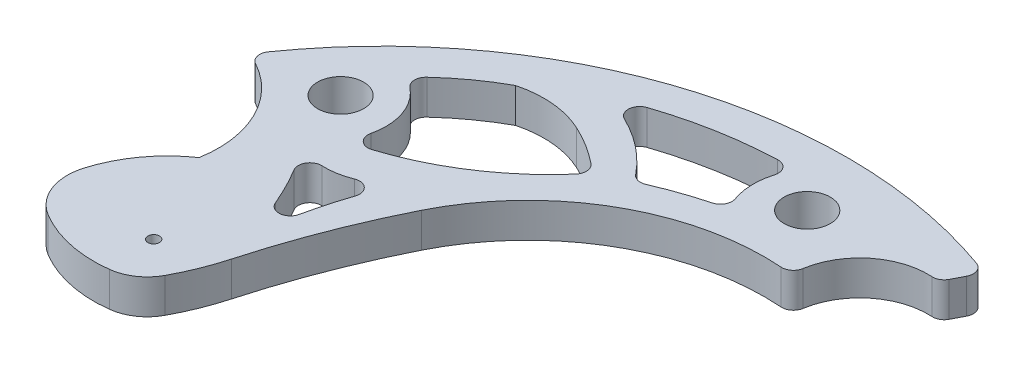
ISO-10303-21;
HEADER;
FILE_DESCRIPTION(('STEP AP214'),'2;1');
FILE_NAME('part.step','',(''),(''),'','','');
FILE_SCHEMA(('AUTOMOTIVE_DESIGN { 1 0 10303 214 1 1 1 1 }'));
ENDSEC;
DATA;
#1=APPLICATION_CONTEXT('core data for automotive mechanical design processes');
#2=APPLICATION_PROTOCOL_DEFINITION('international standard','automotive_design',2000,#1);
#3=PRODUCT_CONTEXT('',#1,'mechanical');
#4=PRODUCT('Part','Part','',(#3));
#5=PRODUCT_RELATED_PRODUCT_CATEGORY('part','',(#4));
#6=PRODUCT_DEFINITION_FORMATION('','',#4);
#7=PRODUCT_DEFINITION_CONTEXT('part definition',#1,'design');
#8=PRODUCT_DEFINITION('design','',#6,#7);
#9=PRODUCT_DEFINITION_SHAPE('','',#8);
#10=(LENGTH_UNIT() NAMED_UNIT(*) SI_UNIT(.MILLI.,.METRE.));
#11=(NAMED_UNIT(*) PLANE_ANGLE_UNIT() SI_UNIT($,.RADIAN.));
#12=(NAMED_UNIT(*) SI_UNIT($,.STERADIAN.) SOLID_ANGLE_UNIT());
#13=UNCERTAINTY_MEASURE_WITH_UNIT(LENGTH_MEASURE(1.E-05),#10,'distance_accuracy_value','');
#14=(GEOMETRIC_REPRESENTATION_CONTEXT(3) GLOBAL_UNCERTAINTY_ASSIGNED_CONTEXT((#13)) GLOBAL_UNIT_ASSIGNED_CONTEXT((#10,
#11,#12)) REPRESENTATION_CONTEXT('',''));
#15=CARTESIAN_POINT('',(0.,0.,0.));
#16=DIRECTION('',(0.,0.,1.));
#17=DIRECTION('',(1.,0.,0.));
#18=AXIS2_PLACEMENT_3D('',#15,#16,#17);
#19=CARTESIAN_POINT('',(36.1901769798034,3.,-25.0084204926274));
#20=DIRECTION('',(0.,-1.,0.));
#21=DIRECTION('',(0.,0.,-1.));
#22=AXIS2_PLACEMENT_3D('',#19,#20,#21);
#23=PLANE('',#22);
#24=CARTESIAN_POINT('',(26.1522054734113,3.,-30.4959441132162));
#25=DIRECTION('',(0.,1.,0.));
#26=DIRECTION('',(0.,0.,1.));
#27=AXIS2_PLACEMENT_3D('',#24,#25,#26);
#28=CIRCLE('',#27,2.);
#29=CARTESIAN_POINT('',(26.1522054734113,3.,-28.4959441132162));
#30=VERTEX_POINT('',#29);
#31=EDGE_CURVE('E691',#30,#30,#28,.T.);
#32=ORIENTED_EDGE('',*,*,#31,.F.);
#33=EDGE_LOOP('',(#32));
#34=FACE_BOUND('',#33,.T.);
#35=CARTESIAN_POINT('',(-2.6982624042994,3.,-18.9009881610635));
#36=DIRECTION('',(0.,1.,0.));
#37=DIRECTION('',(0.,0.,1.));
#38=AXIS2_PLACEMENT_3D('',#35,#36,#37);
#39=CIRCLE('',#38,2.);
#40=CARTESIAN_POINT('',(-2.6982624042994,3.,-16.9009881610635));
#41=VERTEX_POINT('',#40);
#42=EDGE_CURVE('E697',#41,#41,#39,.T.);
#43=ORIENTED_EDGE('',*,*,#42,.F.);
#44=EDGE_LOOP('',(#43));
#45=FACE_BOUND('',#44,.T.);
#46=CARTESIAN_POINT('',(22.3332809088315,3.,1.18231446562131));
#47=DIRECTION('',(0.,1.,0.));
#48=DIRECTION('',(0.,0.,-1.));
#49=AXIS2_PLACEMENT_3D('',#46,#47,#48);
#50=CIRCLE('',#49,34.221936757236);
#51=CARTESIAN_POINT('',(21.077096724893,3.,-33.0165591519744));
#52=VERTEX_POINT('',#51);
#53=CARTESIAN_POINT('',(11.4905747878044,3.,-31.27653146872));
#54=VERTEX_POINT('',#53);
#55=EDGE_CURVE('E703',#52,#54,#50,.T.);
#56=ORIENTED_EDGE('',*,*,#55,.F.);
#57=CARTESIAN_POINT('',(21.1138037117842,3.,-32.0172330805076));
#58=DIRECTION('',(0.,-1.,0.));
#59=DIRECTION('',(0.,0.,-1.));
#60=AXIS2_PLACEMENT_3D('',#57,#58,#59);
#61=CIRCLE('',#60,1.);
#62=CARTESIAN_POINT('',(22.0723027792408,3.,-31.732137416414));
#63=VERTEX_POINT('',#62);
#64=EDGE_CURVE('E476',#52,#63,#61,.T.);
#65=ORIENTED_EDGE('',*,*,#64,.T.);
#66=CARTESIAN_POINT('',(27.4530725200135,3.,-30.1316829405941));
#67=DIRECTION('',(0.,-1.,0.));
#68=DIRECTION('',(0.,0.,1.));
#69=AXIS2_PLACEMENT_3D('',#66,#67,#68);
#70=CIRCLE('',#69,5.61374541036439);
#71=CARTESIAN_POINT('',(22.1672578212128,3.,-28.2411008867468));
#72=VERTEX_POINT('',#71);
#73=EDGE_CURVE('E308',#72,#63,#70,.T.);
#74=ORIENTED_EDGE('',*,*,#73,.F.);
#75=CARTESIAN_POINT('',(21.2256734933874,3.,-27.9043235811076));
#76=DIRECTION('',(0.,-1.,0.));
#77=DIRECTION('',(0.,0.,-1.));
#78=AXIS2_PLACEMENT_3D('',#75,#76,#77);
#79=CIRCLE('',#78,1.);
#80=CARTESIAN_POINT('',(21.4834971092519,3.,-26.9381315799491));
#81=VERTEX_POINT('',#80);
#82=EDGE_CURVE('E468',#72,#81,#79,.T.);
#83=ORIENTED_EDGE('',*,*,#82,.T.);
#84=CARTESIAN_POINT('',(29.4187713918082,3.,2.79924725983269));
#85=DIRECTION('',(0.,-1.,0.));
#86=DIRECTION('',(0.,0.,1.));
#87=AXIS2_PLACEMENT_3D('',#84,#85,#86);
#88=CIRCLE('',#87,30.7779186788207);
#89=CARTESIAN_POINT('',(17.2098235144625,3.,-25.453573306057));
#90=VERTEX_POINT('',#89);
#91=EDGE_CURVE('E710',#90,#81,#88,.T.);
#92=ORIENTED_EDGE('',*,*,#91,.F.);
#93=CARTESIAN_POINT('',(16.8131447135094,3.,-26.3715307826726));
#94=DIRECTION('',(0.,-1.,0.));
#95=DIRECTION('',(0.,0.,-1.));
#96=AXIS2_PLACEMENT_3D('',#93,#94,#95);
#97=CIRCLE('',#96,1.);
#98=CARTESIAN_POINT('',(16.0350198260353,3.,-25.7434211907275));
#99=VERTEX_POINT('',#98);
#100=EDGE_CURVE('E472',#90,#99,#97,.T.);
#101=ORIENTED_EDGE('',*,*,#100,.T.);
#102=CARTESIAN_POINT('',(5.57927762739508,3.,-17.303449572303));
#103=DIRECTION('',(0.,-1.,0.));
#104=DIRECTION('',(0.,0.,-1.));
#105=AXIS2_PLACEMENT_3D('',#102,#103,#104);
#106=CIRCLE('',#105,13.4371003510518);
#107=CARTESIAN_POINT('',(11.3760120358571,3.,-29.4258889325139));
#108=VERTEX_POINT('',#107);
#109=EDGE_CURVE('E706',#108,#99,#106,.T.);
#110=ORIENTED_EDGE('',*,*,#109,.F.);
#111=CARTESIAN_POINT('',(11.8074097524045,3.,-30.3280507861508));
#112=DIRECTION('',(0.,-1.,0.));
#113=DIRECTION('',(0.,0.,-1.));
#114=AXIS2_PLACEMENT_3D('',#111,#112,#113);
#115=CIRCLE('',#114,1.);
#116=EDGE_CURVE('E480',#108,#54,#115,.T.);
#117=ORIENTED_EDGE('',*,*,#116,.T.);
#118=EDGE_LOOP('',(#56,#65,#74,#83,#92,#101,#110,#117));
#119=FACE_BOUND('',#118,.T.);
#120=CARTESIAN_POINT('',(0.,3.,0.));
#121=DIRECTION('',(0.,1.,0.));
#122=DIRECTION('',(0.,0.,1.));
#123=AXIS2_PLACEMENT_3D('',#120,#121,#122);
#124=CIRCLE('',#123,0.5);
#125=CARTESIAN_POINT('',(0.,3.,0.5));
#126=VERTEX_POINT('',#125);
#127=EDGE_CURVE('E319',#126,#126,#124,.T.);
#128=ORIENTED_EDGE('',*,*,#127,.F.);
#129=EDGE_LOOP('',(#128));
#130=FACE_BOUND('',#129,.T.);
#131=CARTESIAN_POINT('',(23.9208432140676,3.,4.15098831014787));
#132=DIRECTION('',(0.,1.,0.));
#133=DIRECTION('',(0.,0.,-1.));
#134=AXIS2_PLACEMENT_3D('',#131,#132,#133);
#135=CIRCLE('',#134,40.3519483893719);
#136=CARTESIAN_POINT('',(37.44992086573,3.,-33.865373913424));
#137=VERTEX_POINT('',#136);
#138=CARTESIAN_POINT('',(-9.09792331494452,3.,-19.0447180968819));
#139=VERTEX_POINT('',#138);
#140=EDGE_CURVE('E331',#137,#139,#135,.T.);
#141=ORIENTED_EDGE('',*,*,#140,.T.);
#142=CARTESIAN_POINT('',(-8.27965386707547,3.,-18.4698832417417));
#143=DIRECTION('',(0.,-1.,0.));
#144=DIRECTION('',(0.,0.,-1.));
#145=AXIS2_PLACEMENT_3D('',#142,#143,#144);
#146=CIRCLE('',#145,1.);
#147=CARTESIAN_POINT('',(-8.75589303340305,3.,-17.5905674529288));
#148=VERTEX_POINT('',#147);
#149=EDGE_CURVE('E504',#139,#148,#146,.F.);
#150=ORIENTED_EDGE('',*,*,#149,.T.);
#151=CARTESIAN_POINT('',(-13.0537265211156,3.,-9.65515787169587));
#152=DIRECTION('',(0.,-1.,0.));
#153=DIRECTION('',(0.,0.,1.));
#154=AXIS2_PLACEMENT_3D('',#151,#152,#153);
#155=CIRCLE('',#154,9.02452757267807);
#156=CARTESIAN_POINT('',(-4.16393548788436,3.,-8.10154489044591));
#157=VERTEX_POINT('',#156);
#158=EDGE_CURVE('E334',#148,#157,#155,.T.);
#159=ORIENTED_EDGE('',*,*,#158,.T.);
#160=CARTESIAN_POINT('',(1.93480597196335,3.,0.752602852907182));
#161=DIRECTION('',(0.,1.,0.));
#162=DIRECTION('',(0.,0.,1.));
#163=AXIS2_PLACEMENT_3D('',#160,#161,#162);
#164=CIRCLE('',#163,10.751305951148);
#165=CARTESIAN_POINT('',(-8.36767887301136,3.,-2.32138245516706));
#166=VERTEX_POINT('',#165);
#167=EDGE_CURVE('E336',#157,#166,#164,.T.);
#168=ORIENTED_EDGE('',*,*,#167,.T.);
#169=CARTESIAN_POINT('',(-4.12389303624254,3.,-1.05515052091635));
#170=DIRECTION('',(0.,1.,0.));
#171=DIRECTION('',(0.,0.,1.));
#172=AXIS2_PLACEMENT_3D('',#169,#170,#171);
#173=CIRCLE('',#172,4.42866362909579);
#174=CARTESIAN_POINT('',(-6.40207694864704,3.,2.74260402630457));
#175=VERTEX_POINT('',#174);
#176=EDGE_CURVE('E338',#166,#175,#173,.T.);
#177=ORIENTED_EDGE('',*,*,#176,.T.);
#178=CARTESIAN_POINT('',(-0.950217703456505,3.,-6.34569789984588));
#179=DIRECTION('',(0.,1.,0.));
#180=DIRECTION('',(0.,0.,1.));
#181=AXIS2_PLACEMENT_3D('',#178,#179,#180);
#182=CIRCLE('',#181,10.5981130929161);
#183=CARTESIAN_POINT('',(0.36441854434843,3.,4.17056249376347));
#184=VERTEX_POINT('',#183);
#185=EDGE_CURVE('E340',#175,#184,#182,.T.);
#186=ORIENTED_EDGE('',*,*,#185,.T.);
#187=CARTESIAN_POINT('',(-0.100414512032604,3.,0.452191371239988));
#188=DIRECTION('',(0.,1.,0.));
#189=DIRECTION('',(0.,0.,1.));
#190=AXIS2_PLACEMENT_3D('',#187,#188,#189);
#191=CIRCLE('',#190,3.74731284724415);
#192=CARTESIAN_POINT('',(3.1999000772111,3.,2.22709339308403));
#193=VERTEX_POINT('',#192);
#194=EDGE_CURVE('E342',#184,#193,#191,.T.);
#195=ORIENTED_EDGE('',*,*,#194,.T.);
#196=CARTESIAN_POINT('',(-14.4275555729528,3.,-7.25291399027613));
#197=DIRECTION('',(0.,1.,0.));
#198=DIRECTION('',(0.,0.,-1.));
#199=AXIS2_PLACEMENT_3D('',#196,#197,#198);
#200=CIRCLE('',#199,20.0149377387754);
#201=CARTESIAN_POINT('',(4.8563646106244,3.,-1.89304878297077));
#202=VERTEX_POINT('',#201);
#203=EDGE_CURVE('E344',#193,#202,#200,.T.);
#204=ORIENTED_EDGE('',*,*,#203,.T.);
#205=CARTESIAN_POINT('',(68.9783873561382,3.,15.929333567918));
#206=DIRECTION('',(0.,-1.,0.));
#207=DIRECTION('',(0.,0.,-1.));
#208=AXIS2_PLACEMENT_3D('',#205,#206,#207);
#209=CIRCLE('',#208,66.5527693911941);
#210=CARTESIAN_POINT('',(9.42965914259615,3.,-13.7896852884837));
#211=VERTEX_POINT('',#210);
#212=EDGE_CURVE('E346',#202,#211,#209,.T.);
#213=ORIENTED_EDGE('',*,*,#212,.T.);
#214=CARTESIAN_POINT('',(27.8052220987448,3.,-4.61898226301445));
#215=DIRECTION('',(0.,-1.,0.));
#216=DIRECTION('',(0.,0.,1.));
#217=AXIS2_PLACEMENT_3D('',#214,#215,#216);
#218=CIRCLE('',#217,20.5368719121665);
#219=CARTESIAN_POINT('',(29.2760593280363,3.,-25.1031162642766));
#220=VERTEX_POINT('',#219);
#221=EDGE_CURVE('E348',#211,#220,#218,.T.);
#222=ORIENTED_EDGE('',*,*,#221,.T.);
#223=CARTESIAN_POINT('',(29.3476786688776,3.,-26.1005483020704));
#224=DIRECTION('',(0.,-1.,0.));
#225=DIRECTION('',(0.,0.,-1.));
#226=AXIS2_PLACEMENT_3D('',#223,#224,#225);
#227=CIRCLE('',#226,1.);
#228=CARTESIAN_POINT('',(30.3351793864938,3.,-25.942933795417));
#229=VERTEX_POINT('',#228);
#230=EDGE_CURVE('E498',#220,#229,#227,.F.);
#231=ORIENTED_EDGE('',*,*,#230,.T.);
#232=CARTESIAN_POINT('',(36.1901769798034,3.,-25.0084204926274));
#233=DIRECTION('',(0.,-1.,0.));
#234=DIRECTION('',(0.,0.,-1.));
#235=AXIS2_PLACEMENT_3D('',#232,#233,#234);
#236=CIRCLE('',#235,5.92910717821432);
#237=CARTESIAN_POINT('',(36.5403153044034,3.,-30.9271800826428));
#238=VERTEX_POINT('',#237);
#239=EDGE_CURVE('E325',#229,#238,#236,.T.);
#240=ORIENTED_EDGE('',*,*,#239,.T.);
#241=CARTESIAN_POINT('',(36.5993694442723,3.,-31.9254348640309));
#242=DIRECTION('',(0.,-1.,0.));
#243=DIRECTION('',(0.,0.,-1.));
#244=AXIS2_PLACEMENT_3D('',#241,#242,#243);
#245=CIRCLE('',#244,1.);
#246=CARTESIAN_POINT('',(37.4878917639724,3.,-31.4666014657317));
#247=VERTEX_POINT('',#246);
#248=EDGE_CURVE('E500',#238,#247,#245,.F.);
#249=ORIENTED_EDGE('',*,*,#248,.T.);
#250=DIRECTION('',(0.458833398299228,0.,-0.888522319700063));
#251=VECTOR('',#250,1.);
#252=CARTESIAN_POINT('',(37.1723743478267,3.,-30.8556078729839));
#253=LINE('',#252,#251);
#254=CARTESIAN_POINT('',(38.0031662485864,3.,-32.4644208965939));
#255=VERTEX_POINT('',#254);
#256=EDGE_CURVE('E328',#247,#255,#253,.T.);
#257=ORIENTED_EDGE('',*,*,#256,.T.);
#258=CARTESIAN_POINT('',(37.1146439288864,3.,-32.9232542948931));
#259=DIRECTION('',(0.,-1.,0.));
#260=DIRECTION('',(0.,0.,-1.));
#261=AXIS2_PLACEMENT_3D('',#258,#259,#260);
#262=CIRCLE('',#261,1.);
#263=EDGE_CURVE('E502',#255,#137,#262,.F.);
#264=ORIENTED_EDGE('',*,*,#263,.T.);
#265=EDGE_LOOP('',(#141,#150,#159,#168,#177,#186,#195,#204,#213,#222,#231,#240,#249,#257,#264));
#266=FACE_BOUND('',#265,.T.);
#267=CARTESIAN_POINT('',(-3.46325413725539,3.,-18.5524292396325));
#268=DIRECTION('',(0.,-1.,0.));
#269=DIRECTION('',(0.,0.,1.));
#270=AXIS2_PLACEMENT_3D('',#267,#268,#269);
#271=CIRCLE('',#270,5.06437808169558);
#272=CARTESIAN_POINT('',(-0.279386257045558,3.,-22.4908185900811));
#273=VERTEX_POINT('',#272);
#274=CARTESIAN_POINT('',(1.46239452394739,3.,-17.3751821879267));
#275=VERTEX_POINT('',#274);
#276=EDGE_CURVE('E317',#273,#275,#271,.T.);
#277=ORIENTED_EDGE('',*,*,#276,.F.);
#278=CARTESIAN_POINT('',(0.349292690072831,3.,-23.2684835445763));
#279=DIRECTION('',(0.,-1.,0.));
#280=DIRECTION('',(0.,0.,-1.));
#281=AXIS2_PLACEMENT_3D('',#278,#279,#280);
#282=CIRCLE('',#281,1.);
#283=CARTESIAN_POINT('',(-0.33020244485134,3.,-24.0021635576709));
#284=VERTEX_POINT('',#283);
#285=EDGE_CURVE('E444',#273,#284,#282,.T.);
#286=ORIENTED_EDGE('',*,*,#285,.T.);
#287=CARTESIAN_POINT('',(15.0701998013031,3.,-7.37368935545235));
#288=DIRECTION('',(0.,1.,0.));
#289=DIRECTION('',(0.,0.,-1.));
#290=AXIS2_PLACEMENT_3D('',#287,#288,#289);
#291=CIRCLE('',#290,22.6644775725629);
#292=CARTESIAN_POINT('',(4.1342229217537,3.,-27.2252120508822));
#293=VERTEX_POINT('',#292);
#294=EDGE_CURVE('E299',#293,#284,#291,.T.);
#295=ORIENTED_EDGE('',*,*,#294,.F.);
#296=CARTESIAN_POINT('',(6.32074341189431,3.,-18.9009881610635));
#297=DIRECTION('',(0.,1.,0.));
#298=DIRECTION('',(0.,0.,-1.));
#299=AXIS2_PLACEMENT_3D('',#296,#297,#298);
#300=CIRCLE('',#299,8.60660067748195);
#301=CARTESIAN_POINT('',(9.95984203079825,3.,-26.7003815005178));
#302=VERTEX_POINT('',#301);
#303=EDGE_CURVE('E284',#302,#293,#300,.T.);
#304=ORIENTED_EDGE('',*,*,#303,.F.);
#305=CARTESIAN_POINT('',(3.1407436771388,3.,-12.0855452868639));
#306=DIRECTION('',(0.,1.,0.));
#307=DIRECTION('',(0.,0.,-1.));
#308=AXIS2_PLACEMENT_3D('',#305,#306,#307);
#309=CIRCLE('',#308,16.1274157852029);
#310=CARTESIAN_POINT('',(13.2816867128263,3.,-24.6256734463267));
#311=VERTEX_POINT('',#310);
#312=EDGE_CURVE('E273',#311,#302,#309,.T.);
#313=ORIENTED_EDGE('',*,*,#312,.F.);
#314=CARTESIAN_POINT('',(12.6528852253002,3.,-23.8481075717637));
#315=DIRECTION('',(0.,-1.,0.));
#316=DIRECTION('',(0.,0.,-1.));
#317=AXIS2_PLACEMENT_3D('',#314,#315,#316);
#318=CIRCLE('',#317,1.);
#319=CARTESIAN_POINT('',(13.4045600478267,3.,-23.1885736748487));
#320=VERTEX_POINT('',#319);
#321=EDGE_CURVE('E436',#311,#320,#318,.T.);
#322=ORIENTED_EDGE('',*,*,#321,.T.);
#323=CARTESIAN_POINT('',(-4.57734917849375,3.,-38.9662454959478));
#324=DIRECTION('',(0.,1.,0.));
#325=DIRECTION('',(0.,0.,-1.));
#326=AXIS2_PLACEMENT_3D('',#323,#324,#325);
#327=CIRCLE('',#326,23.922457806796);
#328=CARTESIAN_POINT('',(2.74091751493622,3.,-16.1906673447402));
#329=VERTEX_POINT('',#328);
#330=EDGE_CURVE('E285',#329,#320,#327,.T.);
#331=ORIENTED_EDGE('',*,*,#330,.F.);
#332=CARTESIAN_POINT('',(2.4350013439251,3.,-17.1427257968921));
#333=DIRECTION('',(0.,-1.,0.));
#334=DIRECTION('',(0.,0.,-1.));
#335=AXIS2_PLACEMENT_3D('',#332,#333,#334);
#336=CIRCLE('',#335,1.);
#337=EDGE_CURVE('E440',#329,#275,#336,.T.);
#338=ORIENTED_EDGE('',*,*,#337,.T.);
#339=EDGE_LOOP('',(#277,#286,#295,#304,#313,#322,#331,#338));
#340=FACE_BOUND('',#339,.T.);
#341=CARTESIAN_POINT('',(-21.7653135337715,3.,2.25661155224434));
#342=DIRECTION('',(0.,-1.,0.));
#343=DIRECTION('',(0.,0.,-1.));
#344=AXIS2_PLACEMENT_3D('',#341,#342,#343);
#345=CIRCLE('',#344,26.3858876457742);
#346=CARTESIAN_POINT('',(0.874070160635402,3.,-11.2960034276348));
#347=VERTEX_POINT('',#346);
#348=CARTESIAN_POINT('',(2.54587875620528,3.,-7.99916712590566));
#349=VERTEX_POINT('',#348);
#350=EDGE_CURVE('E666',#347,#349,#345,.T.);
#351=ORIENTED_EDGE('',*,*,#350,.F.);
#352=CARTESIAN_POINT('',(1.73208123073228,3.,-11.8096346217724));
#353=DIRECTION('',(0.,-1.,0.));
#354=DIRECTION('',(0.,0.,-1.));
#355=AXIS2_PLACEMENT_3D('',#352,#353,#354);
#356=CIRCLE('',#355,1.);
#357=CARTESIAN_POINT('',(1.7734922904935,3.,-12.8087768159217));
#358=VERTEX_POINT('',#357);
#359=EDGE_CURVE('E418',#347,#358,#356,.T.);
#360=ORIENTED_EDGE('',*,*,#359,.T.);
#361=CARTESIAN_POINT('',(2.0097532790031,3.,-18.5091458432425));
#362=DIRECTION('',(0.,-1.,0.));
#363=DIRECTION('',(0.,0.,1.));
#364=AXIS2_PLACEMENT_3D('',#361,#362,#363);
#365=CIRCLE('',#364,5.7052630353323);
#366=CARTESIAN_POINT('',(4.16538173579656,3.,-13.2267891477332));
#367=VERTEX_POINT('',#366);
#368=EDGE_CURVE('E677',#367,#358,#365,.T.);
#369=ORIENTED_EDGE('',*,*,#368,.F.);
#370=CARTESIAN_POINT('',(4.5432132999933,3.,-12.3009147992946));
#371=DIRECTION('',(0.,-1.,0.));
#372=DIRECTION('',(0.,0.,-1.));
#373=AXIS2_PLACEMENT_3D('',#370,#371,#372);
#374=CIRCLE('',#373,1.);
#375=CARTESIAN_POINT('',(5.49075599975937,3.,-11.9812855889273));
#376=VERTEX_POINT('',#375);
#377=EDGE_CURVE('E414',#367,#376,#374,.T.);
#378=ORIENTED_EDGE('',*,*,#377,.T.);
#379=CARTESIAN_POINT('',(38.2916214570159,3.,-0.916755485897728));
#380=DIRECTION('',(0.,-1.,0.));
#381=DIRECTION('',(0.,0.,-1.));
#382=AXIS2_PLACEMENT_3D('',#379,#380,#381);
#383=CIRCLE('',#382,34.6167676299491);
#384=CARTESIAN_POINT('',(4.44500194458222,3.,-8.17808792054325));
#385=VERTEX_POINT('',#384);
#386=EDGE_CURVE('E675',#385,#376,#383,.T.);
#387=ORIENTED_EDGE('',*,*,#386,.F.);
#388=CARTESIAN_POINT('',(3.4672497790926,3.,-8.38785136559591));
#389=DIRECTION('',(0.,-1.,0.));
#390=DIRECTION('',(0.,0.,-1.));
#391=AXIS2_PLACEMENT_3D('',#388,#389,#390);
#392=CIRCLE('',#391,1.);
#393=EDGE_CURVE('E410',#385,#349,#392,.T.);
#394=ORIENTED_EDGE('',*,*,#393,.T.);
#395=EDGE_LOOP('',(#351,#360,#369,#378,#387,#394));
#396=FACE_BOUND('',#395,.T.);
#397=ADVANCED_FACE('F32',(#34,#45,#119,#130,#266,#340,#396),#23,.F.);
#398=CARTESIAN_POINT('',(36.1901769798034,0.,-25.0084204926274));
#399=DIRECTION('',(0.,-1.,0.));
#400=DIRECTION('',(0.,0.,-1.));
#401=AXIS2_PLACEMENT_3D('',#398,#399,#400);
#402=PLANE('',#401);
#403=CARTESIAN_POINT('',(-2.6982624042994,0.,-18.9009881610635));
#404=DIRECTION('',(0.,1.,0.));
#405=DIRECTION('',(0.,0.,1.));
#406=AXIS2_PLACEMENT_3D('',#403,#404,#405);
#407=CIRCLE('',#406,2.);
#408=CARTESIAN_POINT('',(-2.6982624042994,0.,-16.9009881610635));
#409=VERTEX_POINT('',#408);
#410=EDGE_CURVE('E694',#409,#409,#407,.T.);
#411=ORIENTED_EDGE('',*,*,#410,.T.);
#412=EDGE_LOOP('',(#411));
#413=FACE_BOUND('',#412,.T.);
#414=CARTESIAN_POINT('',(-13.0537265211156,0.,-9.65515787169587));
#415=DIRECTION('',(0.,-1.,0.));
#416=DIRECTION('',(0.,0.,1.));
#417=AXIS2_PLACEMENT_3D('',#414,#415,#416);
#418=CIRCLE('',#417,9.02452757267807);
#419=CARTESIAN_POINT('',(-8.75589303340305,0.,-17.5905674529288));
#420=VERTEX_POINT('',#419);
#421=CARTESIAN_POINT('',(-4.16393548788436,0.,-8.10154489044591));
#422=VERTEX_POINT('',#421);
#423=EDGE_CURVE('E358',#420,#422,#418,.T.);
#424=ORIENTED_EDGE('',*,*,#423,.F.);
#425=CARTESIAN_POINT('',(-8.27965386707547,0.,-18.4698832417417));
#426=DIRECTION('',(0.,-1.,0.));
#427=DIRECTION('',(0.,0.,-1.));
#428=AXIS2_PLACEMENT_3D('',#425,#426,#427);
#429=CIRCLE('',#428,1.);
#430=CARTESIAN_POINT('',(-9.09792331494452,0.,-19.0447180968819));
#431=VERTEX_POINT('',#430);
#432=EDGE_CURVE('E491',#420,#431,#429,.T.);
#433=ORIENTED_EDGE('',*,*,#432,.T.);
#434=CARTESIAN_POINT('',(23.9208432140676,0.,4.15098831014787));
#435=DIRECTION('',(0.,1.,0.));
#436=DIRECTION('',(0.,0.,-1.));
#437=AXIS2_PLACEMENT_3D('',#434,#435,#436);
#438=CIRCLE('',#437,40.3519483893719);
#439=CARTESIAN_POINT('',(37.44992086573,0.,-33.865373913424));
#440=VERTEX_POINT('',#439);
#441=EDGE_CURVE('E355',#440,#431,#438,.T.);
#442=ORIENTED_EDGE('',*,*,#441,.F.);
#443=CARTESIAN_POINT('',(37.1146439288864,0.,-32.9232542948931));
#444=DIRECTION('',(0.,-1.,0.));
#445=DIRECTION('',(0.,0.,-1.));
#446=AXIS2_PLACEMENT_3D('',#443,#444,#445);
#447=CIRCLE('',#446,1.);
#448=CARTESIAN_POINT('',(38.0031662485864,0.,-32.4644208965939));
#449=VERTEX_POINT('',#448);
#450=EDGE_CURVE('E489',#440,#449,#447,.T.);
#451=ORIENTED_EDGE('',*,*,#450,.T.);
#452=DIRECTION('',(0.458833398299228,0.,-0.888522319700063));
#453=VECTOR('',#452,1.);
#454=CARTESIAN_POINT('',(37.1723743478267,0.,-30.8556078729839));
#455=LINE('',#454,#453);
#456=CARTESIAN_POINT('',(37.4878917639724,0.,-31.4666014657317));
#457=VERTEX_POINT('',#456);
#458=EDGE_CURVE('E353',#457,#449,#455,.T.);
#459=ORIENTED_EDGE('',*,*,#458,.F.);
#460=CARTESIAN_POINT('',(36.5993694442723,0.,-31.9254348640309));
#461=DIRECTION('',(0.,-1.,0.));
#462=DIRECTION('',(0.,0.,-1.));
#463=AXIS2_PLACEMENT_3D('',#460,#461,#462);
#464=CIRCLE('',#463,1.);
#465=CARTESIAN_POINT('',(36.5403153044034,0.,-30.9271800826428));
#466=VERTEX_POINT('',#465);
#467=EDGE_CURVE('E487',#457,#466,#464,.T.);
#468=ORIENTED_EDGE('',*,*,#467,.T.);
#469=CARTESIAN_POINT('',(36.1901769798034,0.,-25.0084204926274));
#470=DIRECTION('',(0.,-1.,0.));
#471=DIRECTION('',(0.,0.,-1.));
#472=AXIS2_PLACEMENT_3D('',#469,#470,#471);
#473=CIRCLE('',#472,5.92910717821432);
#474=CARTESIAN_POINT('',(30.3351793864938,0.,-25.942933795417));
#475=VERTEX_POINT('',#474);
#476=EDGE_CURVE('E322',#475,#466,#473,.T.);
#477=ORIENTED_EDGE('',*,*,#476,.F.);
#478=CARTESIAN_POINT('',(29.3476786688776,0.,-26.1005483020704));
#479=DIRECTION('',(0.,-1.,0.));
#480=DIRECTION('',(0.,0.,-1.));
#481=AXIS2_PLACEMENT_3D('',#478,#479,#480);
#482=CIRCLE('',#481,1.);
#483=CARTESIAN_POINT('',(29.2760593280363,0.,-25.1031162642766));
#484=VERTEX_POINT('',#483);
#485=EDGE_CURVE('E485',#475,#484,#482,.T.);
#486=ORIENTED_EDGE('',*,*,#485,.T.);
#487=CARTESIAN_POINT('',(27.8052220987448,0.,-4.61898226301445));
#488=DIRECTION('',(0.,-1.,0.));
#489=DIRECTION('',(0.,0.,1.));
#490=AXIS2_PLACEMENT_3D('',#487,#488,#489);
#491=CIRCLE('',#490,20.5368719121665);
#492=CARTESIAN_POINT('',(9.42965914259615,0.,-13.7896852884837));
#493=VERTEX_POINT('',#492);
#494=EDGE_CURVE('E329',#493,#484,#491,.T.);
#495=ORIENTED_EDGE('',*,*,#494,.F.);
#496=CARTESIAN_POINT('',(68.9783873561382,0.,15.929333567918));
#497=DIRECTION('',(0.,-1.,0.));
#498=DIRECTION('',(0.,0.,-1.));
#499=AXIS2_PLACEMENT_3D('',#496,#497,#498);
#500=CIRCLE('',#499,66.5527693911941);
#501=CARTESIAN_POINT('',(4.8563646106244,0.,-1.89304878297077));
#502=VERTEX_POINT('',#501);
#503=EDGE_CURVE('E370',#502,#493,#500,.T.);
#504=ORIENTED_EDGE('',*,*,#503,.F.);
#505=CARTESIAN_POINT('',(-14.4275555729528,0.,-7.25291399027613));
#506=DIRECTION('',(0.,1.,0.));
#507=DIRECTION('',(0.,0.,-1.));
#508=AXIS2_PLACEMENT_3D('',#505,#506,#507);
#509=CIRCLE('',#508,20.0149377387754);
#510=CARTESIAN_POINT('',(3.1999000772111,0.,2.22709339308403));
#511=VERTEX_POINT('',#510);
#512=EDGE_CURVE('E368',#511,#502,#509,.T.);
#513=ORIENTED_EDGE('',*,*,#512,.F.);
#514=CARTESIAN_POINT('',(-0.100414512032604,0.,0.452191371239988));
#515=DIRECTION('',(0.,1.,0.));
#516=DIRECTION('',(0.,0.,1.));
#517=AXIS2_PLACEMENT_3D('',#514,#515,#516);
#518=CIRCLE('',#517,3.74731284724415);
#519=CARTESIAN_POINT('',(0.36441854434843,0.,4.17056249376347));
#520=VERTEX_POINT('',#519);
#521=EDGE_CURVE('E366',#520,#511,#518,.T.);
#522=ORIENTED_EDGE('',*,*,#521,.F.);
#523=CARTESIAN_POINT('',(-0.950217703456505,0.,-6.34569789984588));
#524=DIRECTION('',(0.,1.,0.));
#525=DIRECTION('',(0.,0.,1.));
#526=AXIS2_PLACEMENT_3D('',#523,#524,#525);
#527=CIRCLE('',#526,10.5981130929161);
#528=CARTESIAN_POINT('',(-6.40207694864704,0.,2.74260402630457));
#529=VERTEX_POINT('',#528);
#530=EDGE_CURVE('E364',#529,#520,#527,.T.);
#531=ORIENTED_EDGE('',*,*,#530,.F.);
#532=CARTESIAN_POINT('',(-4.12389303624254,0.,-1.05515052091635));
#533=DIRECTION('',(0.,1.,0.));
#534=DIRECTION('',(0.,0.,1.));
#535=AXIS2_PLACEMENT_3D('',#532,#533,#534);
#536=CIRCLE('',#535,4.42866362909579);
#537=CARTESIAN_POINT('',(-8.36767887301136,0.,-2.32138245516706));
#538=VERTEX_POINT('',#537);
#539=EDGE_CURVE('E362',#538,#529,#536,.T.);
#540=ORIENTED_EDGE('',*,*,#539,.F.);
#541=CARTESIAN_POINT('',(1.93480597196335,0.,0.752602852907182));
#542=DIRECTION('',(0.,1.,0.));
#543=DIRECTION('',(0.,0.,1.));
#544=AXIS2_PLACEMENT_3D('',#541,#542,#543);
#545=CIRCLE('',#544,10.751305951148);
#546=EDGE_CURVE('E360',#422,#538,#545,.T.);
#547=ORIENTED_EDGE('',*,*,#546,.F.);
#548=EDGE_LOOP('',(#424,#433,#442,#451,#459,#468,#477,#486,#495,#504,#513,#522,#531,#540,#547));
#549=FACE_BOUND('',#548,.T.);
#550=CARTESIAN_POINT('',(0.,0.,0.));
#551=DIRECTION('',(0.,1.,0.));
#552=DIRECTION('',(0.,0.,1.));
#553=AXIS2_PLACEMENT_3D('',#550,#551,#552);
#554=CIRCLE('',#553,0.5);
#555=CARTESIAN_POINT('',(0.,0.,0.5));
#556=VERTEX_POINT('',#555);
#557=EDGE_CURVE('E293',#556,#556,#554,.T.);
#558=ORIENTED_EDGE('',*,*,#557,.T.);
#559=EDGE_LOOP('',(#558));
#560=FACE_BOUND('',#559,.T.);
#561=CARTESIAN_POINT('',(15.0701998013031,0.,-7.37368935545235));
#562=DIRECTION('',(0.,1.,0.));
#563=DIRECTION('',(0.,0.,-1.));
#564=AXIS2_PLACEMENT_3D('',#561,#562,#563);
#565=CIRCLE('',#564,22.6644775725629);
#566=CARTESIAN_POINT('',(4.1342229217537,0.,-27.2252120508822));
#567=VERTEX_POINT('',#566);
#568=CARTESIAN_POINT('',(-0.33020244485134,0.,-24.0021635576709));
#569=VERTEX_POINT('',#568);
#570=EDGE_CURVE('E314',#567,#569,#565,.T.);
#571=ORIENTED_EDGE('',*,*,#570,.T.);
#572=CARTESIAN_POINT('',(0.349292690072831,0.,-23.2684835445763));
#573=DIRECTION('',(0.,-1.,0.));
#574=DIRECTION('',(0.,0.,-1.));
#575=AXIS2_PLACEMENT_3D('',#572,#573,#574);
#576=CIRCLE('',#575,1.);
#577=CARTESIAN_POINT('',(-0.279386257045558,0.,-22.4908185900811));
#578=VERTEX_POINT('',#577);
#579=EDGE_CURVE('E442',#569,#578,#576,.F.);
#580=ORIENTED_EDGE('',*,*,#579,.T.);
#581=CARTESIAN_POINT('',(-3.46325413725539,0.,-18.5524292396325));
#582=DIRECTION('',(0.,-1.,0.));
#583=DIRECTION('',(0.,0.,1.));
#584=AXIS2_PLACEMENT_3D('',#581,#582,#583);
#585=CIRCLE('',#584,5.06437808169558);
#586=CARTESIAN_POINT('',(1.46239452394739,0.,-17.3751821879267));
#587=VERTEX_POINT('',#586);
#588=EDGE_CURVE('E304',#578,#587,#585,.T.);
#589=ORIENTED_EDGE('',*,*,#588,.T.);
#590=CARTESIAN_POINT('',(2.4350013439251,0.,-17.1427257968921));
#591=DIRECTION('',(0.,-1.,0.));
#592=DIRECTION('',(0.,0.,-1.));
#593=AXIS2_PLACEMENT_3D('',#590,#591,#592);
#594=CIRCLE('',#593,1.);
#595=CARTESIAN_POINT('',(2.74091751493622,0.,-16.1906673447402));
#596=VERTEX_POINT('',#595);
#597=EDGE_CURVE('E438',#587,#596,#594,.F.);
#598=ORIENTED_EDGE('',*,*,#597,.T.);
#599=CARTESIAN_POINT('',(-4.57734917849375,0.,-38.9662454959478));
#600=DIRECTION('',(0.,1.,0.));
#601=DIRECTION('',(0.,0.,-1.));
#602=AXIS2_PLACEMENT_3D('',#599,#600,#601);
#603=CIRCLE('',#602,23.922457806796);
#604=CARTESIAN_POINT('',(13.4045600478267,0.,-23.1885736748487));
#605=VERTEX_POINT('',#604);
#606=EDGE_CURVE('E307',#596,#605,#603,.T.);
#607=ORIENTED_EDGE('',*,*,#606,.T.);
#608=CARTESIAN_POINT('',(12.6528852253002,0.,-23.8481075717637));
#609=DIRECTION('',(0.,-1.,0.));
#610=DIRECTION('',(0.,0.,-1.));
#611=AXIS2_PLACEMENT_3D('',#608,#609,#610);
#612=CIRCLE('',#611,1.);
#613=CARTESIAN_POINT('',(13.2816867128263,0.,-24.6256734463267));
#614=VERTEX_POINT('',#613);
#615=EDGE_CURVE('E434',#605,#614,#612,.F.);
#616=ORIENTED_EDGE('',*,*,#615,.T.);
#617=CARTESIAN_POINT('',(3.1407436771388,0.,-12.0855452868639));
#618=DIRECTION('',(0.,1.,0.));
#619=DIRECTION('',(0.,0.,-1.));
#620=AXIS2_PLACEMENT_3D('',#617,#618,#619);
#621=CIRCLE('',#620,16.1274157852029);
#622=CARTESIAN_POINT('',(9.95984203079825,0.,-26.7003815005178));
#623=VERTEX_POINT('',#622);
#624=EDGE_CURVE('E311',#614,#623,#621,.T.);
#625=ORIENTED_EDGE('',*,*,#624,.T.);
#626=CARTESIAN_POINT('',(6.32074341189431,0.,-18.9009881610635));
#627=DIRECTION('',(0.,1.,0.));
#628=DIRECTION('',(0.,0.,-1.));
#629=AXIS2_PLACEMENT_3D('',#626,#627,#628);
#630=CIRCLE('',#629,8.60660067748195);
#631=EDGE_CURVE('E292',#623,#567,#630,.T.);
#632=ORIENTED_EDGE('',*,*,#631,.T.);
#633=EDGE_LOOP('',(#571,#580,#589,#598,#607,#616,#625,#632));
#634=FACE_BOUND('',#633,.T.);
#635=CARTESIAN_POINT('',(29.4187713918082,0.,2.79924725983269));
#636=DIRECTION('',(0.,-1.,0.));
#637=DIRECTION('',(0.,0.,1.));
#638=AXIS2_PLACEMENT_3D('',#635,#636,#637);
#639=CIRCLE('',#638,30.7779186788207);
#640=CARTESIAN_POINT('',(17.2098235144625,0.,-25.453573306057));
#641=VERTEX_POINT('',#640);
#642=CARTESIAN_POINT('',(21.4834971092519,0.,-26.9381315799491));
#643=VERTEX_POINT('',#642);
#644=EDGE_CURVE('E720',#641,#643,#639,.T.);
#645=ORIENTED_EDGE('',*,*,#644,.T.);
#646=CARTESIAN_POINT('',(21.2256734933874,0.,-27.9043235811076));
#647=DIRECTION('',(0.,-1.,0.));
#648=DIRECTION('',(0.,0.,-1.));
#649=AXIS2_PLACEMENT_3D('',#646,#647,#648);
#650=CIRCLE('',#649,1.);
#651=CARTESIAN_POINT('',(22.1672578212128,0.,-28.2411008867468));
#652=VERTEX_POINT('',#651);
#653=EDGE_CURVE('E466',#643,#652,#650,.F.);
#654=ORIENTED_EDGE('',*,*,#653,.T.);
#655=CARTESIAN_POINT('',(27.4530725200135,0.,-30.1316829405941));
#656=DIRECTION('',(0.,-1.,0.));
#657=DIRECTION('',(0.,0.,1.));
#658=AXIS2_PLACEMENT_3D('',#655,#656,#657);
#659=CIRCLE('',#658,5.61374541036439);
#660=CARTESIAN_POINT('',(22.0723027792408,0.,-31.732137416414));
#661=VERTEX_POINT('',#660);
#662=EDGE_CURVE('E707',#652,#661,#659,.T.);
#663=ORIENTED_EDGE('',*,*,#662,.T.);
#664=CARTESIAN_POINT('',(21.1138037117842,0.,-32.0172330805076));
#665=DIRECTION('',(0.,-1.,0.));
#666=DIRECTION('',(0.,0.,-1.));
#667=AXIS2_PLACEMENT_3D('',#664,#665,#666);
#668=CIRCLE('',#667,1.);
#669=CARTESIAN_POINT('',(21.077096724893,0.,-33.0165591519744));
#670=VERTEX_POINT('',#669);
#671=EDGE_CURVE('E474',#661,#670,#668,.F.);
#672=ORIENTED_EDGE('',*,*,#671,.T.);
#673=CARTESIAN_POINT('',(22.3332809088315,0.,1.18231446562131));
#674=DIRECTION('',(0.,1.,0.));
#675=DIRECTION('',(0.,0.,-1.));
#676=AXIS2_PLACEMENT_3D('',#673,#674,#675);
#677=CIRCLE('',#676,34.221936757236);
#678=CARTESIAN_POINT('',(11.4905747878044,0.,-31.27653146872));
#679=VERTEX_POINT('',#678);
#680=EDGE_CURVE('E700',#670,#679,#677,.T.);
#681=ORIENTED_EDGE('',*,*,#680,.T.);
#682=CARTESIAN_POINT('',(11.8074097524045,0.,-30.3280507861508));
#683=DIRECTION('',(0.,-1.,0.));
#684=DIRECTION('',(0.,0.,-1.));
#685=AXIS2_PLACEMENT_3D('',#682,#683,#684);
#686=CIRCLE('',#685,1.);
#687=CARTESIAN_POINT('',(11.3760120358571,0.,-29.4258889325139));
#688=VERTEX_POINT('',#687);
#689=EDGE_CURVE('E478',#679,#688,#686,.F.);
#690=ORIENTED_EDGE('',*,*,#689,.T.);
#691=CARTESIAN_POINT('',(5.57927762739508,0.,-17.303449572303));
#692=DIRECTION('',(0.,-1.,0.));
#693=DIRECTION('',(0.,0.,-1.));
#694=AXIS2_PLACEMENT_3D('',#691,#692,#693);
#695=CIRCLE('',#694,13.4371003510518);
#696=CARTESIAN_POINT('',(16.0350198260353,0.,-25.7434211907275));
#697=VERTEX_POINT('',#696);
#698=EDGE_CURVE('E717',#688,#697,#695,.T.);
#699=ORIENTED_EDGE('',*,*,#698,.T.);
#700=CARTESIAN_POINT('',(16.8131447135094,0.,-26.3715307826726));
#701=DIRECTION('',(0.,-1.,0.));
#702=DIRECTION('',(0.,0.,-1.));
#703=AXIS2_PLACEMENT_3D('',#700,#701,#702);
#704=CIRCLE('',#703,1.);
#705=EDGE_CURVE('E470',#697,#641,#704,.F.);
#706=ORIENTED_EDGE('',*,*,#705,.T.);
#707=EDGE_LOOP('',(#645,#654,#663,#672,#681,#690,#699,#706));
#708=FACE_BOUND('',#707,.T.);
#709=CARTESIAN_POINT('',(26.1522054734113,0.,-30.4959441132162));
#710=DIRECTION('',(0.,1.,0.));
#711=DIRECTION('',(0.,0.,1.));
#712=AXIS2_PLACEMENT_3D('',#709,#710,#711);
#713=CIRCLE('',#712,2.);
#714=CARTESIAN_POINT('',(26.1522054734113,0.,-28.4959441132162));
#715=VERTEX_POINT('',#714);
#716=EDGE_CURVE('E682',#715,#715,#713,.T.);
#717=ORIENTED_EDGE('',*,*,#716,.T.);
#718=EDGE_LOOP('',(#717));
#719=FACE_BOUND('',#718,.T.);
#720=CARTESIAN_POINT('',(38.2916214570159,0.,-0.916755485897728));
#721=DIRECTION('',(0.,-1.,0.));
#722=DIRECTION('',(0.,0.,-1.));
#723=AXIS2_PLACEMENT_3D('',#720,#721,#722);
#724=CIRCLE('',#723,34.6167676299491);
#725=CARTESIAN_POINT('',(4.44500194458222,0.,-8.17808792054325));
#726=VERTEX_POINT('',#725);
#727=CARTESIAN_POINT('',(5.49075599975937,0.,-11.9812855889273));
#728=VERTEX_POINT('',#727);
#729=EDGE_CURVE('E667',#726,#728,#724,.T.);
#730=ORIENTED_EDGE('',*,*,#729,.T.);
#731=CARTESIAN_POINT('',(4.5432132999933,0.,-12.3009147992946));
#732=DIRECTION('',(0.,-1.,0.));
#733=DIRECTION('',(0.,0.,-1.));
#734=AXIS2_PLACEMENT_3D('',#731,#732,#733);
#735=CIRCLE('',#734,1.);
#736=CARTESIAN_POINT('',(4.16538173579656,0.,-13.2267891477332));
#737=VERTEX_POINT('',#736);
#738=EDGE_CURVE('E412',#728,#737,#735,.F.);
#739=ORIENTED_EDGE('',*,*,#738,.T.);
#740=CARTESIAN_POINT('',(2.0097532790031,0.,-18.5091458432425));
#741=DIRECTION('',(0.,-1.,0.));
#742=DIRECTION('',(0.,0.,1.));
#743=AXIS2_PLACEMENT_3D('',#740,#741,#742);
#744=CIRCLE('',#743,5.7052630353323);
#745=CARTESIAN_POINT('',(1.7734922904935,0.,-12.8087768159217));
#746=VERTEX_POINT('',#745);
#747=EDGE_CURVE('E660',#737,#746,#744,.T.);
#748=ORIENTED_EDGE('',*,*,#747,.T.);
#749=CARTESIAN_POINT('',(1.73208123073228,0.,-11.8096346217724));
#750=DIRECTION('',(0.,-1.,0.));
#751=DIRECTION('',(0.,0.,-1.));
#752=AXIS2_PLACEMENT_3D('',#749,#750,#751);
#753=CIRCLE('',#752,1.);
#754=CARTESIAN_POINT('',(0.874070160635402,0.,-11.2960034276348));
#755=VERTEX_POINT('',#754);
#756=EDGE_CURVE('E416',#746,#755,#753,.F.);
#757=ORIENTED_EDGE('',*,*,#756,.T.);
#758=CARTESIAN_POINT('',(-21.7653135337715,0.,2.25661155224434));
#759=DIRECTION('',(0.,-1.,0.));
#760=DIRECTION('',(0.,0.,-1.));
#761=AXIS2_PLACEMENT_3D('',#758,#759,#760);
#762=CIRCLE('',#761,26.3858876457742);
#763=CARTESIAN_POINT('',(2.54587875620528,0.,-7.99916712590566));
#764=VERTEX_POINT('',#763);
#765=EDGE_CURVE('E687',#755,#764,#762,.T.);
#766=ORIENTED_EDGE('',*,*,#765,.T.);
#767=CARTESIAN_POINT('',(3.4672497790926,0.,-8.38785136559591));
#768=DIRECTION('',(0.,-1.,0.));
#769=DIRECTION('',(0.,0.,-1.));
#770=AXIS2_PLACEMENT_3D('',#767,#768,#769);
#771=CIRCLE('',#770,1.);
#772=EDGE_CURVE('E408',#764,#726,#771,.F.);
#773=ORIENTED_EDGE('',*,*,#772,.T.);
#774=EDGE_LOOP('',(#730,#739,#748,#757,#766,#773));
#775=FACE_BOUND('',#774,.T.);
#776=ADVANCED_FACE('F528',(#413,#549,#560,#634,#708,#719,#775),#402,.T.);
#777=CARTESIAN_POINT('',(36.1901769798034,3.,-25.0084204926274));
#778=DIRECTION('',(0.,-1.,0.));
#779=DIRECTION('',(0.,0.,-1.));
#780=AXIS2_PLACEMENT_3D('',#777,#778,#779);
#781=CYLINDRICAL_SURFACE('',#780,5.92910717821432);
#782=ORIENTED_EDGE('',*,*,#476,.T.);
#783=DIRECTION('',(0.,-1.,0.));
#784=VECTOR('',#783,1.);
#785=CARTESIAN_POINT('',(36.5403153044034,3.,-30.9271800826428));
#786=LINE('',#785,#784);
#787=EDGE_CURVE('E40',#466,#238,#786,.F.);
#788=ORIENTED_EDGE('',*,*,#787,.T.);
#789=ORIENTED_EDGE('',*,*,#239,.F.);
#790=DIRECTION('',(0.,-1.,0.));
#791=VECTOR('',#790,1.);
#792=CARTESIAN_POINT('',(30.3351793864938,3.,-25.942933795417));
#793=LINE('',#792,#791);
#794=EDGE_CURVE('E510',#229,#475,#793,.T.);
#795=ORIENTED_EDGE('',*,*,#794,.T.);
#796=EDGE_LOOP('',(#782,#788,#789,#795));
#797=FACE_BOUND('',#796,.T.);
#798=ADVANCED_FACE('F515',(#797),#781,.F.);
#799=CARTESIAN_POINT('',(37.1723743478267,3.,-30.8556078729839));
#800=DIRECTION('',(-0.888522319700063,0.,-0.458833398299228));
#801=DIRECTION('',(-0.458833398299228,0.,0.888522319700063));
#802=AXIS2_PLACEMENT_3D('',#799,#800,#801);
#803=PLANE('',#802);
#804=ORIENTED_EDGE('',*,*,#458,.T.);
#805=DIRECTION('',(0.,-1.,0.));
#806=VECTOR('',#805,1.);
#807=CARTESIAN_POINT('',(38.0031662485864,3.,-32.4644208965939));
#808=LINE('',#807,#806);
#809=EDGE_CURVE('E53',#449,#255,#808,.F.);
#810=ORIENTED_EDGE('',*,*,#809,.T.);
#811=ORIENTED_EDGE('',*,*,#256,.F.);
#812=DIRECTION('',(0.,-1.,0.));
#813=VECTOR('',#812,1.);
#814=CARTESIAN_POINT('',(37.4878917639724,3.,-31.4666014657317));
#815=LINE('',#814,#813);
#816=EDGE_CURVE('E506',#247,#457,#815,.T.);
#817=ORIENTED_EDGE('',*,*,#816,.T.);
#818=EDGE_LOOP('',(#804,#810,#811,#817));
#819=FACE_BOUND('',#818,.T.);
#820=ADVANCED_FACE('F525',(#819),#803,.F.);
#821=CARTESIAN_POINT('',(23.9208432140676,3.,4.15098831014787));
#822=DIRECTION('',(0.,-1.,0.));
#823=DIRECTION('',(0.,0.,-1.));
#824=AXIS2_PLACEMENT_3D('',#821,#822,#823);
#825=CYLINDRICAL_SURFACE('',#824,40.3519483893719);
#826=ORIENTED_EDGE('',*,*,#441,.T.);
#827=DIRECTION('',(0.,-1.,0.));
#828=VECTOR('',#827,1.);
#829=CARTESIAN_POINT('',(-9.09792331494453,3.,-19.0447180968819));
#830=LINE('',#829,#828);
#831=EDGE_CURVE('E496',#431,#139,#830,.F.);
#832=ORIENTED_EDGE('',*,*,#831,.T.);
#833=ORIENTED_EDGE('',*,*,#140,.F.);
#834=DIRECTION('',(0.,-1.,0.));
#835=VECTOR('',#834,1.);
#836=CARTESIAN_POINT('',(37.44992086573,3.,-33.865373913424));
#837=LINE('',#836,#835);
#838=EDGE_CURVE('E493',#137,#440,#837,.T.);
#839=ORIENTED_EDGE('',*,*,#838,.T.);
#840=EDGE_LOOP('',(#826,#832,#833,#839));
#841=FACE_BOUND('',#840,.T.);
#842=ADVANCED_FACE('F537',(#841),#825,.T.);
#843=CARTESIAN_POINT('',(-13.0537265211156,3.,-9.65515787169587));
#844=DIRECTION('',(0.,-1.,0.));
#845=DIRECTION('',(0.,0.,-1.));
#846=AXIS2_PLACEMENT_3D('',#843,#844,#845);
#847=CYLINDRICAL_SURFACE('',#846,9.02452757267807);
#848=ORIENTED_EDGE('',*,*,#158,.F.);
#849=DIRECTION('',(0.,-1.,0.));
#850=VECTOR('',#849,1.);
#851=CARTESIAN_POINT('',(-8.75589303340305,3.,-17.5905674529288));
#852=LINE('',#851,#850);
#853=EDGE_CURVE('E482',#148,#420,#852,.T.);
#854=ORIENTED_EDGE('',*,*,#853,.T.);
#855=ORIENTED_EDGE('',*,*,#423,.T.);
#856=DIRECTION('',(0.,-1.,0.));
#857=VECTOR('',#856,1.);
#858=CARTESIAN_POINT('',(-4.16393548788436,3.,-8.10154489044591));
#859=LINE('',#858,#857);
#860=EDGE_CURVE('E390',#157,#422,#859,.T.);
#861=ORIENTED_EDGE('',*,*,#860,.F.);
#862=EDGE_LOOP('',(#848,#854,#855,#861));
#863=FACE_BOUND('',#862,.T.);
#864=ADVANCED_FACE('F545',(#863),#847,.F.);
#865=CARTESIAN_POINT('',(1.93480597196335,3.,0.752602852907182));
#866=DIRECTION('',(0.,-1.,0.));
#867=DIRECTION('',(0.,0.,-1.));
#868=AXIS2_PLACEMENT_3D('',#865,#866,#867);
#869=CYLINDRICAL_SURFACE('',#868,10.751305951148);
#870=ORIENTED_EDGE('',*,*,#546,.T.);
#871=DIRECTION('',(0.,-1.,0.));
#872=VECTOR('',#871,1.);
#873=CARTESIAN_POINT('',(-8.36767887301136,3.,-2.32138245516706));
#874=LINE('',#873,#872);
#875=EDGE_CURVE('E387',#166,#538,#874,.T.);
#876=ORIENTED_EDGE('',*,*,#875,.F.);
#877=ORIENTED_EDGE('',*,*,#167,.F.);
#878=ORIENTED_EDGE('',*,*,#860,.T.);
#879=EDGE_LOOP('',(#870,#876,#877,#878));
#880=FACE_BOUND('',#879,.T.);
#881=ADVANCED_FACE('F552',(#880),#869,.T.);
#882=CARTESIAN_POINT('',(-4.12389303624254,3.,-1.05515052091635));
#883=DIRECTION('',(0.,-1.,0.));
#884=DIRECTION('',(0.,0.,-1.));
#885=AXIS2_PLACEMENT_3D('',#882,#883,#884);
#886=CYLINDRICAL_SURFACE('',#885,4.42866362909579);
#887=ORIENTED_EDGE('',*,*,#539,.T.);
#888=DIRECTION('',(0.,-1.,0.));
#889=VECTOR('',#888,1.);
#890=CARTESIAN_POINT('',(-6.40207694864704,3.,2.74260402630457));
#891=LINE('',#890,#889);
#892=EDGE_CURVE('E384',#175,#529,#891,.T.);
#893=ORIENTED_EDGE('',*,*,#892,.F.);
#894=ORIENTED_EDGE('',*,*,#176,.F.);
#895=ORIENTED_EDGE('',*,*,#875,.T.);
#896=EDGE_LOOP('',(#887,#893,#894,#895));
#897=FACE_BOUND('',#896,.T.);
#898=ADVANCED_FACE('F556',(#897),#886,.T.);
#899=CARTESIAN_POINT('',(-0.950217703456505,3.,-6.34569789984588));
#900=DIRECTION('',(0.,-1.,0.));
#901=DIRECTION('',(0.,0.,-1.));
#902=AXIS2_PLACEMENT_3D('',#899,#900,#901);
#903=CYLINDRICAL_SURFACE('',#902,10.5981130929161);
#904=ORIENTED_EDGE('',*,*,#530,.T.);
#905=DIRECTION('',(0.,-1.,0.));
#906=VECTOR('',#905,1.);
#907=CARTESIAN_POINT('',(0.36441854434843,3.,4.17056249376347));
#908=LINE('',#907,#906);
#909=EDGE_CURVE('E381',#184,#520,#908,.T.);
#910=ORIENTED_EDGE('',*,*,#909,.F.);
#911=ORIENTED_EDGE('',*,*,#185,.F.);
#912=ORIENTED_EDGE('',*,*,#892,.T.);
#913=EDGE_LOOP('',(#904,#910,#911,#912));
#914=FACE_BOUND('',#913,.T.);
#915=ADVANCED_FACE('F563',(#914),#903,.T.);
#916=CARTESIAN_POINT('',(-0.100414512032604,3.,0.452191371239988));
#917=DIRECTION('',(0.,-1.,0.));
#918=DIRECTION('',(0.,0.,-1.));
#919=AXIS2_PLACEMENT_3D('',#916,#917,#918);
#920=CYLINDRICAL_SURFACE('',#919,3.74731284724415);
#921=ORIENTED_EDGE('',*,*,#521,.T.);
#922=DIRECTION('',(0.,-1.,0.));
#923=VECTOR('',#922,1.);
#924=CARTESIAN_POINT('',(3.1999000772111,3.,2.22709339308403));
#925=LINE('',#924,#923);
#926=EDGE_CURVE('E378',#193,#511,#925,.T.);
#927=ORIENTED_EDGE('',*,*,#926,.F.);
#928=ORIENTED_EDGE('',*,*,#194,.F.);
#929=ORIENTED_EDGE('',*,*,#909,.T.);
#930=EDGE_LOOP('',(#921,#927,#928,#929));
#931=FACE_BOUND('',#930,.T.);
#932=ADVANCED_FACE('F566',(#931),#920,.T.);
#933=CARTESIAN_POINT('',(-14.4275555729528,3.,-7.25291399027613));
#934=DIRECTION('',(0.,-1.,0.));
#935=DIRECTION('',(0.,0.,-1.));
#936=AXIS2_PLACEMENT_3D('',#933,#934,#935);
#937=CYLINDRICAL_SURFACE('',#936,20.0149377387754);
#938=ORIENTED_EDGE('',*,*,#512,.T.);
#939=DIRECTION('',(0.,-1.,0.));
#940=VECTOR('',#939,1.);
#941=CARTESIAN_POINT('',(4.8563646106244,3.,-1.89304878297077));
#942=LINE('',#941,#940);
#943=EDGE_CURVE('E375',#202,#502,#942,.T.);
#944=ORIENTED_EDGE('',*,*,#943,.F.);
#945=ORIENTED_EDGE('',*,*,#203,.F.);
#946=ORIENTED_EDGE('',*,*,#926,.T.);
#947=EDGE_LOOP('',(#938,#944,#945,#946));
#948=FACE_BOUND('',#947,.T.);
#949=ADVANCED_FACE('F571',(#948),#937,.T.);
#950=CARTESIAN_POINT('',(68.9783873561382,3.,15.929333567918));
#951=DIRECTION('',(0.,-1.,0.));
#952=DIRECTION('',(0.,0.,-1.));
#953=AXIS2_PLACEMENT_3D('',#950,#951,#952);
#954=CYLINDRICAL_SURFACE('',#953,66.5527693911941);
#955=ORIENTED_EDGE('',*,*,#503,.T.);
#956=DIRECTION('',(0.,-1.,0.));
#957=VECTOR('',#956,1.);
#958=CARTESIAN_POINT('',(9.42965914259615,3.,-13.7896852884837));
#959=LINE('',#958,#957);
#960=EDGE_CURVE('E350',#211,#493,#959,.T.);
#961=ORIENTED_EDGE('',*,*,#960,.F.);
#962=ORIENTED_EDGE('',*,*,#212,.F.);
#963=ORIENTED_EDGE('',*,*,#943,.T.);
#964=EDGE_LOOP('',(#955,#961,#962,#963));
#965=FACE_BOUND('',#964,.T.);
#966=ADVANCED_FACE('F575',(#965),#954,.F.);
#967=CARTESIAN_POINT('',(27.8052220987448,3.,-4.61898226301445));
#968=DIRECTION('',(0.,-1.,0.));
#969=DIRECTION('',(0.,0.,-1.));
#970=AXIS2_PLACEMENT_3D('',#967,#968,#969);
#971=CYLINDRICAL_SURFACE('',#970,20.5368719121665);
#972=ORIENTED_EDGE('',*,*,#494,.T.);
#973=DIRECTION('',(0.,-1.,0.));
#974=VECTOR('',#973,1.);
#975=CARTESIAN_POINT('',(29.2760593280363,3.,-25.1031162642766));
#976=LINE('',#975,#974);
#977=EDGE_CURVE('E11',#484,#220,#976,.F.);
#978=ORIENTED_EDGE('',*,*,#977,.T.);
#979=ORIENTED_EDGE('',*,*,#221,.F.);
#980=ORIENTED_EDGE('',*,*,#960,.T.);
#981=EDGE_LOOP('',(#972,#978,#979,#980));
#982=FACE_BOUND('',#981,.T.);
#983=ADVANCED_FACE('F578',(#982),#971,.F.);
#984=CARTESIAN_POINT('',(0.,3.,0.));
#985=DIRECTION('',(0.,-1.,0.));
#986=DIRECTION('',(0.,0.,-1.));
#987=AXIS2_PLACEMENT_3D('',#984,#985,#986);
#988=CYLINDRICAL_SURFACE('',#987,0.5);
#989=ORIENTED_EDGE('',*,*,#127,.T.);
#990=EDGE_LOOP('',(#989));
#991=FACE_BOUND('',#990,.T.);
#992=ORIENTED_EDGE('',*,*,#557,.F.);
#993=EDGE_LOOP('',(#992));
#994=FACE_BOUND('',#993,.T.);
#995=ADVANCED_FACE('F580',(#991,#994),#988,.F.);
#996=CARTESIAN_POINT('',(-3.46325413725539,3.,-18.5524292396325));
#997=DIRECTION('',(0.,-1.,0.));
#998=DIRECTION('',(0.,0.,-1.));
#999=AXIS2_PLACEMENT_3D('',#996,#997,#998);
#1000=CYLINDRICAL_SURFACE('',#999,5.06437808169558);
#1001=ORIENTED_EDGE('',*,*,#276,.T.);
#1002=DIRECTION('',(0.,-1.,0.));
#1003=VECTOR('',#1002,1.);
#1004=CARTESIAN_POINT('',(1.46239452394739,3.,-17.3751821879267));
#1005=LINE('',#1004,#1003);
#1006=EDGE_CURVE('E428',#275,#587,#1005,.T.);
#1007=ORIENTED_EDGE('',*,*,#1006,.T.);
#1008=ORIENTED_EDGE('',*,*,#588,.F.);
#1009=DIRECTION('',(0.,-1.,0.));
#1010=VECTOR('',#1009,1.);
#1011=CARTESIAN_POINT('',(-0.279386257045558,3.,-22.4908185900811));
#1012=LINE('',#1011,#1010);
#1013=EDGE_CURVE('E426',#578,#273,#1012,.F.);
#1014=ORIENTED_EDGE('',*,*,#1013,.T.);
#1015=EDGE_LOOP('',(#1001,#1007,#1008,#1014));
#1016=FACE_BOUND('',#1015,.T.);
#1017=ADVANCED_FACE('F586',(#1016),#1000,.T.);
#1018=CARTESIAN_POINT('',(-4.57734917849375,3.,-38.9662454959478));
#1019=DIRECTION('',(0.,-1.,0.));
#1020=DIRECTION('',(0.,0.,-1.));
#1021=AXIS2_PLACEMENT_3D('',#1018,#1019,#1020);
#1022=CYLINDRICAL_SURFACE('',#1021,23.922457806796);
#1023=ORIENTED_EDGE('',*,*,#330,.T.);
#1024=DIRECTION('',(0.,-1.,0.));
#1025=VECTOR('',#1024,1.);
#1026=CARTESIAN_POINT('',(13.4045600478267,3.,-23.1885736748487));
#1027=LINE('',#1026,#1025);
#1028=EDGE_CURVE('E422',#320,#605,#1027,.T.);
#1029=ORIENTED_EDGE('',*,*,#1028,.T.);
#1030=ORIENTED_EDGE('',*,*,#606,.F.);
#1031=DIRECTION('',(0.,-1.,0.));
#1032=VECTOR('',#1031,1.);
#1033=CARTESIAN_POINT('',(2.74091751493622,3.,-16.1906673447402));
#1034=LINE('',#1033,#1032);
#1035=EDGE_CURVE('E420',#596,#329,#1034,.F.);
#1036=ORIENTED_EDGE('',*,*,#1035,.T.);
#1037=EDGE_LOOP('',(#1023,#1029,#1030,#1036));
#1038=FACE_BOUND('',#1037,.T.);
#1039=ADVANCED_FACE('F603',(#1038),#1022,.F.);
#1040=CARTESIAN_POINT('',(3.1407436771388,3.,-12.0855452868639));
#1041=DIRECTION('',(0.,-1.,0.));
#1042=DIRECTION('',(0.,0.,-1.));
#1043=AXIS2_PLACEMENT_3D('',#1040,#1041,#1042);
#1044=CYLINDRICAL_SURFACE('',#1043,16.1274157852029);
#1045=ORIENTED_EDGE('',*,*,#624,.F.);
#1046=DIRECTION('',(0.,-1.,0.));
#1047=VECTOR('',#1046,1.);
#1048=CARTESIAN_POINT('',(13.2816867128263,3.,-24.6256734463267));
#1049=LINE('',#1048,#1047);
#1050=EDGE_CURVE('E280',#614,#311,#1049,.F.);
#1051=ORIENTED_EDGE('',*,*,#1050,.T.);
#1052=ORIENTED_EDGE('',*,*,#312,.T.);
#1053=DIRECTION('',(0.,-1.,0.));
#1054=VECTOR('',#1053,1.);
#1055=CARTESIAN_POINT('',(9.95984203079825,3.,-26.7003815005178));
#1056=LINE('',#1055,#1054);
#1057=EDGE_CURVE('E277',#302,#623,#1056,.T.);
#1058=ORIENTED_EDGE('',*,*,#1057,.T.);
#1059=EDGE_LOOP('',(#1045,#1051,#1052,#1058));
#1060=FACE_BOUND('',#1059,.T.);
#1061=ADVANCED_FACE('F276',(#1060),#1044,.F.);
#1062=CARTESIAN_POINT('',(6.32074341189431,3.,-18.9009881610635));
#1063=DIRECTION('',(0.,-1.,0.));
#1064=DIRECTION('',(0.,0.,-1.));
#1065=AXIS2_PLACEMENT_3D('',#1062,#1063,#1064);
#1066=CYLINDRICAL_SURFACE('',#1065,8.60660067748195);
#1067=ORIENTED_EDGE('',*,*,#631,.F.);
#1068=ORIENTED_EDGE('',*,*,#1057,.F.);
#1069=ORIENTED_EDGE('',*,*,#303,.T.);
#1070=DIRECTION('',(0.,-1.,0.));
#1071=VECTOR('',#1070,1.);
#1072=CARTESIAN_POINT('',(4.1342229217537,3.,-27.2252120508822));
#1073=LINE('',#1072,#1071);
#1074=EDGE_CURVE('E294',#293,#567,#1073,.T.);
#1075=ORIENTED_EDGE('',*,*,#1074,.T.);
#1076=EDGE_LOOP('',(#1067,#1068,#1069,#1075));
#1077=FACE_BOUND('',#1076,.T.);
#1078=ADVANCED_FACE('F289',(#1077),#1066,.F.);
#1079=CARTESIAN_POINT('',(15.0701998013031,3.,-7.37368935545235));
#1080=DIRECTION('',(0.,-1.,0.));
#1081=DIRECTION('',(0.,0.,-1.));
#1082=AXIS2_PLACEMENT_3D('',#1079,#1080,#1081);
#1083=CYLINDRICAL_SURFACE('',#1082,22.6644775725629);
#1084=ORIENTED_EDGE('',*,*,#294,.T.);
#1085=DIRECTION('',(0.,-1.,0.));
#1086=VECTOR('',#1085,1.);
#1087=CARTESIAN_POINT('',(-0.33020244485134,3.,-24.0021635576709));
#1088=LINE('',#1087,#1086);
#1089=EDGE_CURVE('E431',#284,#569,#1088,.T.);
#1090=ORIENTED_EDGE('',*,*,#1089,.T.);
#1091=ORIENTED_EDGE('',*,*,#570,.F.);
#1092=ORIENTED_EDGE('',*,*,#1074,.F.);
#1093=EDGE_LOOP('',(#1084,#1090,#1091,#1092));
#1094=FACE_BOUND('',#1093,.T.);
#1095=ADVANCED_FACE('F612',(#1094),#1083,.F.);
#1096=CARTESIAN_POINT('',(22.3332809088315,3.,1.18231446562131));
#1097=DIRECTION('',(0.,-1.,0.));
#1098=DIRECTION('',(0.,0.,-1.));
#1099=AXIS2_PLACEMENT_3D('',#1096,#1097,#1098);
#1100=CYLINDRICAL_SURFACE('',#1099,34.221936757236);
#1101=ORIENTED_EDGE('',*,*,#680,.F.);
#1102=DIRECTION('',(0.,-1.,0.));
#1103=VECTOR('',#1102,1.);
#1104=CARTESIAN_POINT('',(21.077096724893,3.,-33.0165591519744));
#1105=LINE('',#1104,#1103);
#1106=EDGE_CURVE('E464',#670,#52,#1105,.F.);
#1107=ORIENTED_EDGE('',*,*,#1106,.T.);
#1108=ORIENTED_EDGE('',*,*,#55,.T.);
#1109=DIRECTION('',(0.,-1.,0.));
#1110=VECTOR('',#1109,1.);
#1111=CARTESIAN_POINT('',(11.4905747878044,3.,-31.27653146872));
#1112=LINE('',#1111,#1110);
#1113=EDGE_CURVE('E461',#54,#679,#1112,.T.);
#1114=ORIENTED_EDGE('',*,*,#1113,.T.);
#1115=EDGE_LOOP('',(#1101,#1107,#1108,#1114));
#1116=FACE_BOUND('',#1115,.T.);
#1117=ADVANCED_FACE('F615',(#1116),#1100,.F.);
#1118=CARTESIAN_POINT('',(5.57927762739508,3.,-17.303449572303));
#1119=DIRECTION('',(0.,-1.,0.));
#1120=DIRECTION('',(0.,0.,-1.));
#1121=AXIS2_PLACEMENT_3D('',#1118,#1119,#1120);
#1122=CYLINDRICAL_SURFACE('',#1121,13.4371003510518);
#1123=ORIENTED_EDGE('',*,*,#109,.T.);
#1124=DIRECTION('',(0.,-1.,0.));
#1125=VECTOR('',#1124,1.);
#1126=CARTESIAN_POINT('',(16.0350198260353,3.,-25.7434211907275));
#1127=LINE('',#1126,#1125);
#1128=EDGE_CURVE('E458',#99,#697,#1127,.T.);
#1129=ORIENTED_EDGE('',*,*,#1128,.T.);
#1130=ORIENTED_EDGE('',*,*,#698,.F.);
#1131=DIRECTION('',(0.,-1.,0.));
#1132=VECTOR('',#1131,1.);
#1133=CARTESIAN_POINT('',(11.3760120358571,3.,-29.4258889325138));
#1134=LINE('',#1133,#1132);
#1135=EDGE_CURVE('E456',#688,#108,#1134,.F.);
#1136=ORIENTED_EDGE('',*,*,#1135,.T.);
#1137=EDGE_LOOP('',(#1123,#1129,#1130,#1136));
#1138=FACE_BOUND('',#1137,.T.);
#1139=ADVANCED_FACE('F619',(#1138),#1122,.T.);
#1140=CARTESIAN_POINT('',(29.4187713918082,3.,2.79924725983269));
#1141=DIRECTION('',(0.,-1.,0.));
#1142=DIRECTION('',(0.,0.,-1.));
#1143=AXIS2_PLACEMENT_3D('',#1140,#1141,#1142);
#1144=CYLINDRICAL_SURFACE('',#1143,30.7779186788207);
#1145=ORIENTED_EDGE('',*,*,#91,.T.);
#1146=DIRECTION('',(0.,-1.,0.));
#1147=VECTOR('',#1146,1.);
#1148=CARTESIAN_POINT('',(21.4834971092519,3.,-26.9381315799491));
#1149=LINE('',#1148,#1147);
#1150=EDGE_CURVE('E448',#81,#643,#1149,.T.);
#1151=ORIENTED_EDGE('',*,*,#1150,.T.);
#1152=ORIENTED_EDGE('',*,*,#644,.F.);
#1153=DIRECTION('',(0.,-1.,0.));
#1154=VECTOR('',#1153,1.);
#1155=CARTESIAN_POINT('',(17.2098235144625,3.,-25.453573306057));
#1156=LINE('',#1155,#1154);
#1157=EDGE_CURVE('E446',#641,#90,#1156,.F.);
#1158=ORIENTED_EDGE('',*,*,#1157,.T.);
#1159=EDGE_LOOP('',(#1145,#1151,#1152,#1158));
#1160=FACE_BOUND('',#1159,.T.);
#1161=ADVANCED_FACE('F623',(#1160),#1144,.T.);
#1162=CARTESIAN_POINT('',(27.4530725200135,3.,-30.1316829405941));
#1163=DIRECTION('',(0.,-1.,0.));
#1164=DIRECTION('',(0.,0.,-1.));
#1165=AXIS2_PLACEMENT_3D('',#1162,#1163,#1164);
#1166=CYLINDRICAL_SURFACE('',#1165,5.61374541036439);
#1167=ORIENTED_EDGE('',*,*,#662,.F.);
#1168=DIRECTION('',(0.,-1.,0.));
#1169=VECTOR('',#1168,1.);
#1170=CARTESIAN_POINT('',(22.1672578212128,3.,-28.2411008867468));
#1171=LINE('',#1170,#1169);
#1172=EDGE_CURVE('E454',#652,#72,#1171,.F.);
#1173=ORIENTED_EDGE('',*,*,#1172,.T.);
#1174=ORIENTED_EDGE('',*,*,#73,.T.);
#1175=DIRECTION('',(0.,-1.,0.));
#1176=VECTOR('',#1175,1.);
#1177=CARTESIAN_POINT('',(22.0723027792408,3.,-31.732137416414));
#1178=LINE('',#1177,#1176);
#1179=EDGE_CURVE('E451',#63,#661,#1178,.T.);
#1180=ORIENTED_EDGE('',*,*,#1179,.T.);
#1181=EDGE_LOOP('',(#1167,#1173,#1174,#1180));
#1182=FACE_BOUND('',#1181,.T.);
#1183=ADVANCED_FACE('F627',(#1182),#1166,.T.);
#1184=CARTESIAN_POINT('',(-2.6982624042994,3.,-18.9009881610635));
#1185=DIRECTION('',(0.,-1.,0.));
#1186=DIRECTION('',(0.,0.,-1.));
#1187=AXIS2_PLACEMENT_3D('',#1184,#1185,#1186);
#1188=CYLINDRICAL_SURFACE('',#1187,2.);
#1189=ORIENTED_EDGE('',*,*,#42,.T.);
#1190=EDGE_LOOP('',(#1189));
#1191=FACE_BOUND('',#1190,.T.);
#1192=ORIENTED_EDGE('',*,*,#410,.F.);
#1193=EDGE_LOOP('',(#1192));
#1194=FACE_BOUND('',#1193,.T.);
#1195=ADVANCED_FACE('F631',(#1191,#1194),#1188,.F.);
#1196=CARTESIAN_POINT('',(26.1522054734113,3.,-30.4959441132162));
#1197=DIRECTION('',(0.,-1.,0.));
#1198=DIRECTION('',(0.,0.,-1.));
#1199=AXIS2_PLACEMENT_3D('',#1196,#1197,#1198);
#1200=CYLINDRICAL_SURFACE('',#1199,2.);
#1201=ORIENTED_EDGE('',*,*,#31,.T.);
#1202=EDGE_LOOP('',(#1201));
#1203=FACE_BOUND('',#1202,.T.);
#1204=ORIENTED_EDGE('',*,*,#716,.F.);
#1205=EDGE_LOOP('',(#1204));
#1206=FACE_BOUND('',#1205,.T.);
#1207=ADVANCED_FACE('F635',(#1203,#1206),#1200,.F.);
#1208=CARTESIAN_POINT('',(-21.7653135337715,3.,2.25661155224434));
#1209=DIRECTION('',(0.,-1.,0.));
#1210=DIRECTION('',(0.,0.,-1.));
#1211=AXIS2_PLACEMENT_3D('',#1208,#1209,#1210);
#1212=CYLINDRICAL_SURFACE('',#1211,26.3858876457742);
#1213=ORIENTED_EDGE('',*,*,#350,.T.);
#1214=DIRECTION('',(0.,-1.,0.));
#1215=VECTOR('',#1214,1.);
#1216=CARTESIAN_POINT('',(2.54587875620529,3.,-7.99916712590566));
#1217=LINE('',#1216,#1215);
#1218=EDGE_CURVE('E395',#349,#764,#1217,.T.);
#1219=ORIENTED_EDGE('',*,*,#1218,.T.);
#1220=ORIENTED_EDGE('',*,*,#765,.F.);
#1221=DIRECTION('',(0.,-1.,0.));
#1222=VECTOR('',#1221,1.);
#1223=CARTESIAN_POINT('',(0.874070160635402,3.,-11.2960034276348));
#1224=LINE('',#1223,#1222);
#1225=EDGE_CURVE('E393',#755,#347,#1224,.F.);
#1226=ORIENTED_EDGE('',*,*,#1225,.T.);
#1227=EDGE_LOOP('',(#1213,#1219,#1220,#1226));
#1228=FACE_BOUND('',#1227,.T.);
#1229=ADVANCED_FACE('F639',(#1228),#1212,.T.);
#1230=CARTESIAN_POINT('',(38.2916214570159,3.,-0.916755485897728));
#1231=DIRECTION('',(0.,-1.,0.));
#1232=DIRECTION('',(0.,0.,-1.));
#1233=AXIS2_PLACEMENT_3D('',#1230,#1231,#1232);
#1234=CYLINDRICAL_SURFACE('',#1233,34.6167676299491);
#1235=ORIENTED_EDGE('',*,*,#729,.F.);
#1236=DIRECTION('',(0.,-1.,0.));
#1237=VECTOR('',#1236,1.);
#1238=CARTESIAN_POINT('',(4.44500194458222,3.,-8.17808792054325));
#1239=LINE('',#1238,#1237);
#1240=EDGE_CURVE('E401',#726,#385,#1239,.F.);
#1241=ORIENTED_EDGE('',*,*,#1240,.T.);
#1242=ORIENTED_EDGE('',*,*,#386,.T.);
#1243=DIRECTION('',(0.,-1.,0.));
#1244=VECTOR('',#1243,1.);
#1245=CARTESIAN_POINT('',(5.49075599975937,3.,-11.9812855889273));
#1246=LINE('',#1245,#1244);
#1247=EDGE_CURVE('E398',#376,#728,#1246,.T.);
#1248=ORIENTED_EDGE('',*,*,#1247,.T.);
#1249=EDGE_LOOP('',(#1235,#1241,#1242,#1248));
#1250=FACE_BOUND('',#1249,.T.);
#1251=ADVANCED_FACE('F643',(#1250),#1234,.T.);
#1252=CARTESIAN_POINT('',(2.0097532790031,3.,-18.5091458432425));
#1253=DIRECTION('',(0.,-1.,0.));
#1254=DIRECTION('',(0.,0.,-1.));
#1255=AXIS2_PLACEMENT_3D('',#1252,#1253,#1254);
#1256=CYLINDRICAL_SURFACE('',#1255,5.7052630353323);
#1257=ORIENTED_EDGE('',*,*,#747,.F.);
#1258=DIRECTION('',(0.,-1.,0.));
#1259=VECTOR('',#1258,1.);
#1260=CARTESIAN_POINT('',(4.16538173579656,3.,-13.2267891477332));
#1261=LINE('',#1260,#1259);
#1262=EDGE_CURVE('E406',#737,#367,#1261,.F.);
#1263=ORIENTED_EDGE('',*,*,#1262,.T.);
#1264=ORIENTED_EDGE('',*,*,#368,.T.);
#1265=DIRECTION('',(0.,-1.,0.));
#1266=VECTOR('',#1265,1.);
#1267=CARTESIAN_POINT('',(1.7734922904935,3.,-12.8087768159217));
#1268=LINE('',#1267,#1266);
#1269=EDGE_CURVE('E403',#358,#746,#1268,.T.);
#1270=ORIENTED_EDGE('',*,*,#1269,.T.);
#1271=EDGE_LOOP('',(#1257,#1263,#1264,#1270));
#1272=FACE_BOUND('',#1271,.T.);
#1273=ADVANCED_FACE('F647',(#1272),#1256,.T.);
#1274=CARTESIAN_POINT('',(3.4672497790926,3.,-8.38785136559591));
#1275=DIRECTION('',(0.,1.,0.));
#1276=DIRECTION('',(0.,0.,1.));
#1277=AXIS2_PLACEMENT_3D('',#1274,#1275,#1276);
#1278=CYLINDRICAL_SURFACE('',#1277,1.);
#1279=ORIENTED_EDGE('',*,*,#393,.F.);
#1280=ORIENTED_EDGE('',*,*,#1240,.F.);
#1281=ORIENTED_EDGE('',*,*,#772,.F.);
#1282=ORIENTED_EDGE('',*,*,#1218,.F.);
#1283=EDGE_LOOP('',(#1279,#1280,#1281,#1282));
#1284=FACE_BOUND('',#1283,.T.);
#1285=ADVANCED_FACE('F650',(#1284),#1278,.F.);
#1286=CARTESIAN_POINT('',(4.5432132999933,3.,-12.3009147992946));
#1287=DIRECTION('',(0.,1.,0.));
#1288=DIRECTION('',(0.,0.,1.));
#1289=AXIS2_PLACEMENT_3D('',#1286,#1287,#1288);
#1290=CYLINDRICAL_SURFACE('',#1289,1.);
#1291=ORIENTED_EDGE('',*,*,#377,.F.);
#1292=ORIENTED_EDGE('',*,*,#1262,.F.);
#1293=ORIENTED_EDGE('',*,*,#738,.F.);
#1294=ORIENTED_EDGE('',*,*,#1247,.F.);
#1295=EDGE_LOOP('',(#1291,#1292,#1293,#1294));
#1296=FACE_BOUND('',#1295,.T.);
#1297=ADVANCED_FACE('F655',(#1296),#1290,.F.);
#1298=CARTESIAN_POINT('',(1.73208123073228,3.,-11.8096346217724));
#1299=DIRECTION('',(0.,1.,0.));
#1300=DIRECTION('',(0.,0.,1.));
#1301=AXIS2_PLACEMENT_3D('',#1298,#1299,#1300);
#1302=CYLINDRICAL_SURFACE('',#1301,1.);
#1303=ORIENTED_EDGE('',*,*,#359,.F.);
#1304=ORIENTED_EDGE('',*,*,#1225,.F.);
#1305=ORIENTED_EDGE('',*,*,#756,.F.);
#1306=ORIENTED_EDGE('',*,*,#1269,.F.);
#1307=EDGE_LOOP('',(#1303,#1304,#1305,#1306));
#1308=FACE_BOUND('',#1307,.T.);
#1309=ADVANCED_FACE('F915',(#1308),#1302,.F.);
#1310=CARTESIAN_POINT('',(12.6528852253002,3.,-23.8481075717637));
#1311=DIRECTION('',(0.,1.,0.));
#1312=DIRECTION('',(0.,0.,1.));
#1313=AXIS2_PLACEMENT_3D('',#1310,#1311,#1312);
#1314=CYLINDRICAL_SURFACE('',#1313,1.);
#1315=ORIENTED_EDGE('',*,*,#321,.F.);
#1316=ORIENTED_EDGE('',*,*,#1050,.F.);
#1317=ORIENTED_EDGE('',*,*,#615,.F.);
#1318=ORIENTED_EDGE('',*,*,#1028,.F.);
#1319=EDGE_LOOP('',(#1315,#1316,#1317,#1318));
#1320=FACE_BOUND('',#1319,.T.);
#1321=ADVANCED_FACE('F733',(#1320),#1314,.F.);
#1322=CARTESIAN_POINT('',(2.4350013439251,3.,-17.1427257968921));
#1323=DIRECTION('',(0.,-1.,0.));
#1324=DIRECTION('',(0.,0.,-1.));
#1325=AXIS2_PLACEMENT_3D('',#1322,#1323,#1324);
#1326=CYLINDRICAL_SURFACE('',#1325,1.);
#1327=ORIENTED_EDGE('',*,*,#337,.F.);
#1328=ORIENTED_EDGE('',*,*,#1035,.F.);
#1329=ORIENTED_EDGE('',*,*,#597,.F.);
#1330=ORIENTED_EDGE('',*,*,#1006,.F.);
#1331=EDGE_LOOP('',(#1327,#1328,#1329,#1330));
#1332=FACE_BOUND('',#1331,.T.);
#1333=ADVANCED_FACE('F737',(#1332),#1326,.F.);
#1334=CARTESIAN_POINT('',(0.349292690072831,3.,-23.2684835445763));
#1335=DIRECTION('',(0.,-1.,0.));
#1336=DIRECTION('',(0.,0.,-1.));
#1337=AXIS2_PLACEMENT_3D('',#1334,#1335,#1336);
#1338=CYLINDRICAL_SURFACE('',#1337,1.);
#1339=ORIENTED_EDGE('',*,*,#285,.F.);
#1340=ORIENTED_EDGE('',*,*,#1013,.F.);
#1341=ORIENTED_EDGE('',*,*,#579,.F.);
#1342=ORIENTED_EDGE('',*,*,#1089,.F.);
#1343=EDGE_LOOP('',(#1339,#1340,#1341,#1342));
#1344=FACE_BOUND('',#1343,.T.);
#1345=ADVANCED_FACE('F743',(#1344),#1338,.F.);
#1346=CARTESIAN_POINT('',(21.2256734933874,3.,-27.9043235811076));
#1347=DIRECTION('',(0.,1.,0.));
#1348=DIRECTION('',(0.,0.,1.));
#1349=AXIS2_PLACEMENT_3D('',#1346,#1347,#1348);
#1350=CYLINDRICAL_SURFACE('',#1349,1.);
#1351=ORIENTED_EDGE('',*,*,#82,.F.);
#1352=ORIENTED_EDGE('',*,*,#1172,.F.);
#1353=ORIENTED_EDGE('',*,*,#653,.F.);
#1354=ORIENTED_EDGE('',*,*,#1150,.F.);
#1355=EDGE_LOOP('',(#1351,#1352,#1353,#1354));
#1356=FACE_BOUND('',#1355,.T.);
#1357=ADVANCED_FACE('F747',(#1356),#1350,.F.);
#1358=CARTESIAN_POINT('',(16.8131447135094,3.,-26.3715307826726));
#1359=DIRECTION('',(0.,1.,0.));
#1360=DIRECTION('',(0.,0.,1.));
#1361=AXIS2_PLACEMENT_3D('',#1358,#1359,#1360);
#1362=CYLINDRICAL_SURFACE('',#1361,1.);
#1363=ORIENTED_EDGE('',*,*,#100,.F.);
#1364=ORIENTED_EDGE('',*,*,#1157,.F.);
#1365=ORIENTED_EDGE('',*,*,#705,.F.);
#1366=ORIENTED_EDGE('',*,*,#1128,.F.);
#1367=EDGE_LOOP('',(#1363,#1364,#1365,#1366));
#1368=FACE_BOUND('',#1367,.T.);
#1369=ADVANCED_FACE('F753',(#1368),#1362,.F.);
#1370=CARTESIAN_POINT('',(21.1138037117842,3.,-32.0172330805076));
#1371=DIRECTION('',(0.,-1.,0.));
#1372=DIRECTION('',(0.,0.,-1.));
#1373=AXIS2_PLACEMENT_3D('',#1370,#1371,#1372);
#1374=CYLINDRICAL_SURFACE('',#1373,1.);
#1375=ORIENTED_EDGE('',*,*,#64,.F.);
#1376=ORIENTED_EDGE('',*,*,#1106,.F.);
#1377=ORIENTED_EDGE('',*,*,#671,.F.);
#1378=ORIENTED_EDGE('',*,*,#1179,.F.);
#1379=EDGE_LOOP('',(#1375,#1376,#1377,#1378));
#1380=FACE_BOUND('',#1379,.T.);
#1381=ADVANCED_FACE('F761',(#1380),#1374,.F.);
#1382=CARTESIAN_POINT('',(11.8074097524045,3.,-30.3280507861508));
#1383=DIRECTION('',(0.,-1.,0.));
#1384=DIRECTION('',(0.,0.,-1.));
#1385=AXIS2_PLACEMENT_3D('',#1382,#1383,#1384);
#1386=CYLINDRICAL_SURFACE('',#1385,1.);
#1387=ORIENTED_EDGE('',*,*,#116,.F.);
#1388=ORIENTED_EDGE('',*,*,#1135,.F.);
#1389=ORIENTED_EDGE('',*,*,#689,.F.);
#1390=ORIENTED_EDGE('',*,*,#1113,.F.);
#1391=EDGE_LOOP('',(#1387,#1388,#1389,#1390));
#1392=FACE_BOUND('',#1391,.T.);
#1393=ADVANCED_FACE('F765',(#1392),#1386,.F.);
#1394=CARTESIAN_POINT('',(-8.27965386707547,3.,-18.4698832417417));
#1395=DIRECTION('',(0.,1.,0.));
#1396=DIRECTION('',(0.,0.,1.));
#1397=AXIS2_PLACEMENT_3D('',#1394,#1395,#1396);
#1398=CYLINDRICAL_SURFACE('',#1397,1.);
#1399=ORIENTED_EDGE('',*,*,#149,.F.);
#1400=ORIENTED_EDGE('',*,*,#831,.F.);
#1401=ORIENTED_EDGE('',*,*,#432,.F.);
#1402=ORIENTED_EDGE('',*,*,#853,.F.);
#1403=EDGE_LOOP('',(#1399,#1400,#1401,#1402));
#1404=FACE_BOUND('',#1403,.T.);
#1405=ADVANCED_FACE('F543',(#1404),#1398,.T.);
#1406=CARTESIAN_POINT('',(37.1146439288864,3.,-32.9232542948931));
#1407=DIRECTION('',(0.,-1.,0.));
#1408=DIRECTION('',(0.,0.,-1.));
#1409=AXIS2_PLACEMENT_3D('',#1406,#1407,#1408);
#1410=CYLINDRICAL_SURFACE('',#1409,1.);
#1411=ORIENTED_EDGE('',*,*,#263,.F.);
#1412=ORIENTED_EDGE('',*,*,#809,.F.);
#1413=ORIENTED_EDGE('',*,*,#450,.F.);
#1414=ORIENTED_EDGE('',*,*,#838,.F.);
#1415=EDGE_LOOP('',(#1411,#1412,#1413,#1414));
#1416=FACE_BOUND('',#1415,.T.);
#1417=ADVANCED_FACE('F534',(#1416),#1410,.T.);
#1418=CARTESIAN_POINT('',(36.5993694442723,3.,-31.9254348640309));
#1419=DIRECTION('',(0.,-1.,0.));
#1420=DIRECTION('',(0.,0.,-1.));
#1421=AXIS2_PLACEMENT_3D('',#1418,#1419,#1420);
#1422=CYLINDRICAL_SURFACE('',#1421,1.);
#1423=ORIENTED_EDGE('',*,*,#248,.F.);
#1424=ORIENTED_EDGE('',*,*,#787,.F.);
#1425=ORIENTED_EDGE('',*,*,#467,.F.);
#1426=ORIENTED_EDGE('',*,*,#816,.F.);
#1427=EDGE_LOOP('',(#1423,#1424,#1425,#1426));
#1428=FACE_BOUND('',#1427,.T.);
#1429=ADVANCED_FACE('F523',(#1428),#1422,.T.);
#1430=CARTESIAN_POINT('',(29.3476786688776,3.,-26.1005483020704));
#1431=DIRECTION('',(0.,-1.,0.));
#1432=DIRECTION('',(0.,0.,-1.));
#1433=AXIS2_PLACEMENT_3D('',#1430,#1431,#1432);
#1434=CYLINDRICAL_SURFACE('',#1433,1.);
#1435=ORIENTED_EDGE('',*,*,#230,.F.);
#1436=ORIENTED_EDGE('',*,*,#977,.F.);
#1437=ORIENTED_EDGE('',*,*,#485,.F.);
#1438=ORIENTED_EDGE('',*,*,#794,.F.);
#1439=EDGE_LOOP('',(#1435,#1436,#1437,#1438));
#1440=FACE_BOUND('',#1439,.T.);
#1441=ADVANCED_FACE('F34',(#1440),#1434,.T.);
#1442=CLOSED_SHELL('',(#397,#776,#798,#820,#842,#864,#881,#898,#915,#932,#949,#966,#983,#995,
#1017,#1039,#1061,#1078,#1095,#1117,#1139,#1161,#1183,#1195,#1207,#1229,#1251,#1273,#1285,#1297,
#1309,#1321,#1333,#1345,#1357,#1369,#1381,#1393,#1405,#1417,#1429,#1441));
#1443=MANIFOLD_SOLID_BREP('B2',#1442);
#1444=ADVANCED_BREP_SHAPE_REPRESENTATION('',(#18,#1443),#14);
#1445=SHAPE_DEFINITION_REPRESENTATION(#9,#1444);
ENDSEC;
END-ISO-10303-21;
